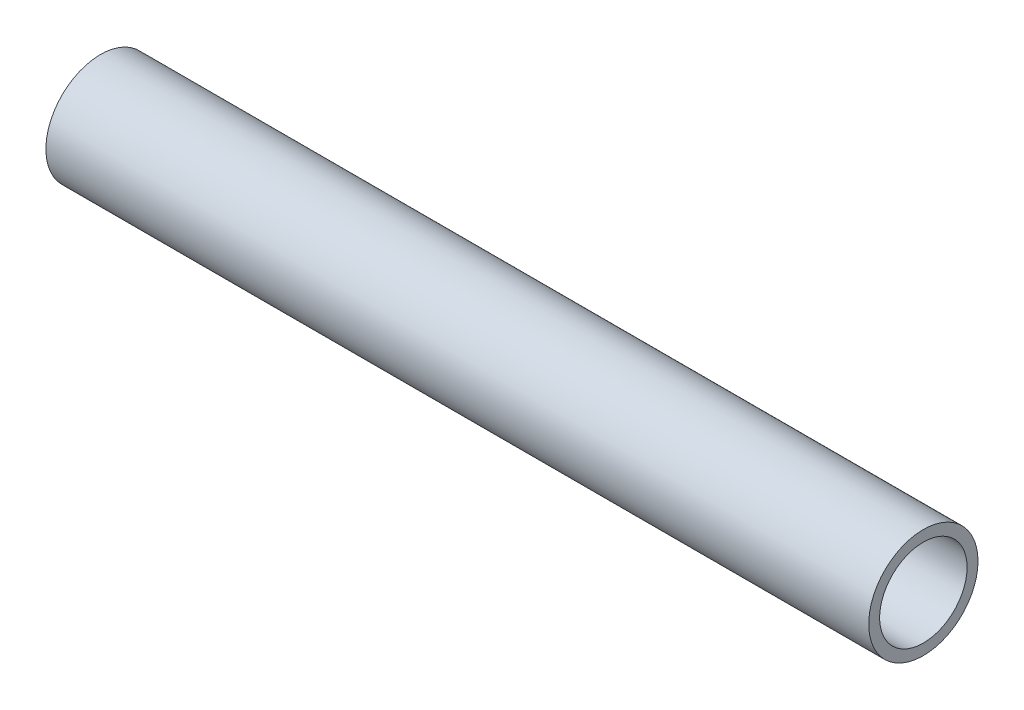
ISO-10303-21;
HEADER;
FILE_DESCRIPTION(('STEP AP214'),'2;1');
FILE_NAME('part.step','',(''),(''),'','','');
FILE_SCHEMA(('AUTOMOTIVE_DESIGN { 1 0 10303 214 1 1 1 1 }'));
ENDSEC;
DATA;
#1=APPLICATION_CONTEXT('core data for automotive mechanical design processes');
#2=APPLICATION_PROTOCOL_DEFINITION('international standard','automotive_design',2000,#1);
#3=PRODUCT_CONTEXT('',#1,'mechanical');
#4=PRODUCT('Part','Part','',(#3));
#5=PRODUCT_RELATED_PRODUCT_CATEGORY('part','',(#4));
#6=PRODUCT_DEFINITION_FORMATION('','',#4);
#7=PRODUCT_DEFINITION_CONTEXT('part definition',#1,'design');
#8=PRODUCT_DEFINITION('design','',#6,#7);
#9=PRODUCT_DEFINITION_SHAPE('','',#8);
#10=(LENGTH_UNIT() NAMED_UNIT(*) SI_UNIT(.MILLI.,.METRE.));
#11=(NAMED_UNIT(*) PLANE_ANGLE_UNIT() SI_UNIT($,.RADIAN.));
#12=(NAMED_UNIT(*) SI_UNIT($,.STERADIAN.) SOLID_ANGLE_UNIT());
#13=UNCERTAINTY_MEASURE_WITH_UNIT(LENGTH_MEASURE(1.E-05),#10,'distance_accuracy_value','');
#14=(GEOMETRIC_REPRESENTATION_CONTEXT(3) GLOBAL_UNCERTAINTY_ASSIGNED_CONTEXT((#13)) GLOBAL_UNIT_ASSIGNED_CONTEXT((#10,
#11,#12)) REPRESENTATION_CONTEXT('',''));
#15=CARTESIAN_POINT('',(0.,0.,0.));
#16=DIRECTION('',(0.,0.,1.));
#17=DIRECTION('',(1.,0.,0.));
#18=AXIS2_PLACEMENT_3D('',#15,#16,#17);
#19=CARTESIAN_POINT('',(119.507,0.,0.));
#20=DIRECTION('',(1.,0.,0.));
#21=DIRECTION('',(0.,0.,-1.));
#22=AXIS2_PLACEMENT_3D('',#19,#20,#21);
#23=PLANE('',#22);
#24=CARTESIAN_POINT('',(119.507,0.,0.));
#25=DIRECTION('',(1.,0.,0.));
#26=DIRECTION('',(0.,0.,-1.));
#27=AXIS2_PLACEMENT_3D('',#24,#25,#26);
#28=CIRCLE('',#27,15.875);
#29=CARTESIAN_POINT('',(119.507,0.,-15.875));
#30=VERTEX_POINT('',#29);
#31=EDGE_CURVE('E10',#30,#30,#28,.T.);
#32=ORIENTED_EDGE('',*,*,#31,.T.);
#33=EDGE_LOOP('',(#32));
#34=FACE_BOUND('',#33,.T.);
#35=CARTESIAN_POINT('',(119.507,0.,0.));
#36=DIRECTION('',(1.,0.,0.));
#37=DIRECTION('',(0.,0.,-1.));
#38=AXIS2_PLACEMENT_3D('',#35,#36,#37);
#39=CIRCLE('',#38,12.7);
#40=CARTESIAN_POINT('',(119.507,0.,-12.7));
#41=VERTEX_POINT('',#40);
#42=EDGE_CURVE('E46',#41,#41,#39,.T.);
#43=ORIENTED_EDGE('',*,*,#42,.F.);
#44=EDGE_LOOP('',(#43));
#45=FACE_BOUND('',#44,.T.);
#46=ADVANCED_FACE('F35',(#34,#45),#23,.T.);
#47=CARTESIAN_POINT('',(-119.507,0.,0.));
#48=DIRECTION('',(1.,0.,0.));
#49=DIRECTION('',(0.,0.,-1.));
#50=AXIS2_PLACEMENT_3D('',#47,#48,#49);
#51=PLANE('',#50);
#52=CARTESIAN_POINT('',(-119.507,0.,0.));
#53=DIRECTION('',(1.,0.,0.));
#54=DIRECTION('',(0.,0.,-1.));
#55=AXIS2_PLACEMENT_3D('',#52,#53,#54);
#56=CIRCLE('',#55,15.875);
#57=CARTESIAN_POINT('',(-119.507,0.,-15.875));
#58=VERTEX_POINT('',#57);
#59=EDGE_CURVE('E39',#58,#58,#56,.T.);
#60=ORIENTED_EDGE('',*,*,#59,.F.);
#61=EDGE_LOOP('',(#60));
#62=FACE_BOUND('',#61,.T.);
#63=CARTESIAN_POINT('',(-119.507,0.,0.));
#64=DIRECTION('',(1.,0.,0.));
#65=DIRECTION('',(0.,0.,-1.));
#66=AXIS2_PLACEMENT_3D('',#63,#64,#65);
#67=CIRCLE('',#66,12.7);
#68=CARTESIAN_POINT('',(-119.507,0.,-12.7));
#69=VERTEX_POINT('',#68);
#70=EDGE_CURVE('E48',#69,#69,#67,.T.);
#71=ORIENTED_EDGE('',*,*,#70,.T.);
#72=EDGE_LOOP('',(#71));
#73=FACE_BOUND('',#72,.T.);
#74=ADVANCED_FACE('F58',(#62,#73),#51,.F.);
#75=CARTESIAN_POINT('',(119.507,0.,0.));
#76=DIRECTION('',(-1.,0.,0.));
#77=DIRECTION('',(0.,0.,1.));
#78=AXIS2_PLACEMENT_3D('',#75,#76,#77);
#79=CYLINDRICAL_SURFACE('',#78,15.875);
#80=ORIENTED_EDGE('',*,*,#31,.F.);
#81=EDGE_LOOP('',(#80));
#82=FACE_BOUND('',#81,.T.);
#83=ORIENTED_EDGE('',*,*,#59,.T.);
#84=EDGE_LOOP('',(#83));
#85=FACE_BOUND('',#84,.T.);
#86=ADVANCED_FACE('F37',(#82,#85),#79,.T.);
#87=CARTESIAN_POINT('',(119.507,0.,0.));
#88=DIRECTION('',(-1.,0.,0.));
#89=DIRECTION('',(0.,0.,1.));
#90=AXIS2_PLACEMENT_3D('',#87,#88,#89);
#91=CYLINDRICAL_SURFACE('',#90,12.7);
#92=ORIENTED_EDGE('',*,*,#42,.T.);
#93=EDGE_LOOP('',(#92));
#94=FACE_BOUND('',#93,.T.);
#95=ORIENTED_EDGE('',*,*,#70,.F.);
#96=EDGE_LOOP('',(#95));
#97=FACE_BOUND('',#96,.T.);
#98=ADVANCED_FACE('F54',(#94,#97),#91,.F.);
#99=CLOSED_SHELL('',(#46,#74,#86,#98));
#100=MANIFOLD_SOLID_BREP('B2',#99);
#101=ADVANCED_BREP_SHAPE_REPRESENTATION('',(#18,#100),#14);
#102=SHAPE_DEFINITION_REPRESENTATION(#9,#101);
ENDSEC;
END-ISO-10303-21;
